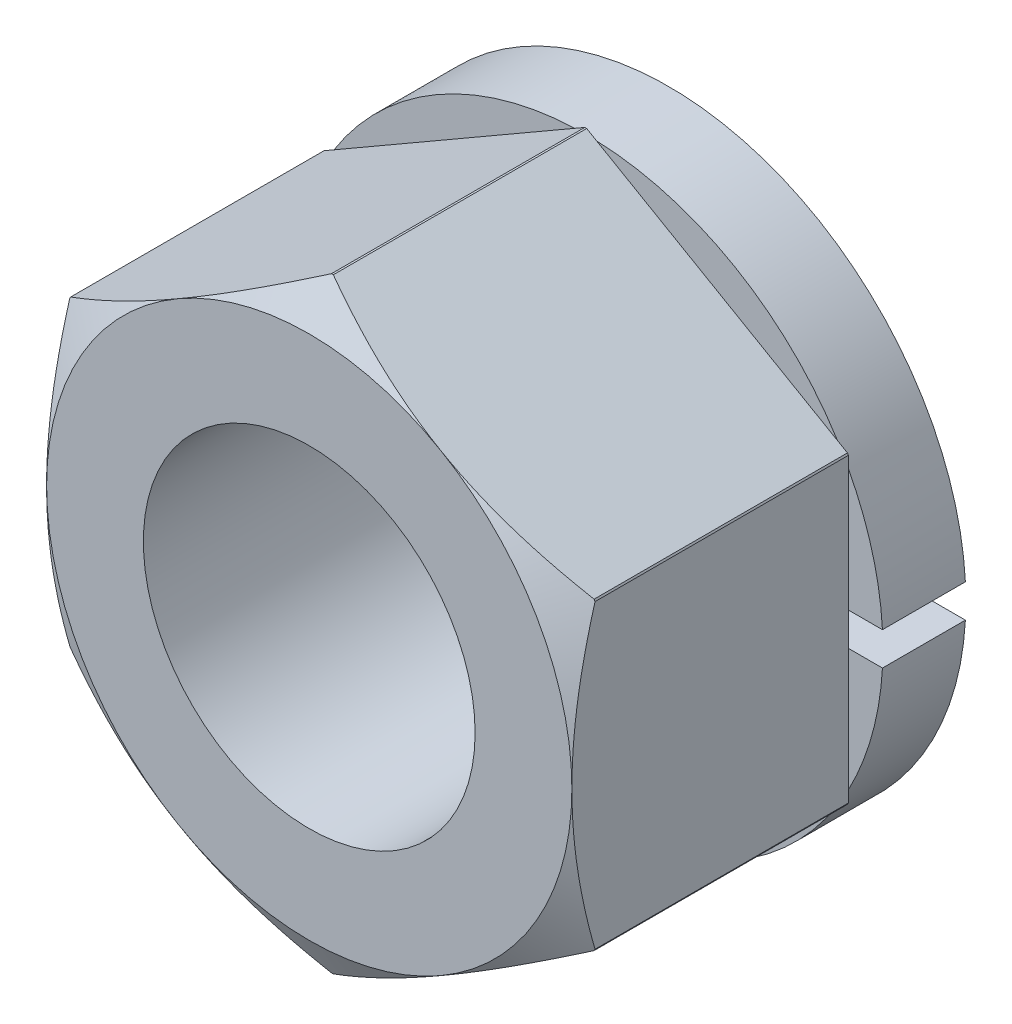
ISO-10303-21;
HEADER;
FILE_DESCRIPTION(('STEP AP214'),'2;1');
FILE_NAME('part.step','',(''),(''),'','','');
FILE_SCHEMA(('AUTOMOTIVE_DESIGN { 1 0 10303 214 1 1 1 1 }'));
ENDSEC;
DATA;
#1=APPLICATION_CONTEXT('core data for automotive mechanical design processes');
#2=APPLICATION_PROTOCOL_DEFINITION('international standard','automotive_design',2000,#1);
#3=PRODUCT_CONTEXT('',#1,'mechanical');
#4=PRODUCT('Part','Part','',(#3));
#5=PRODUCT_RELATED_PRODUCT_CATEGORY('part','',(#4));
#6=PRODUCT_DEFINITION_FORMATION('','',#4);
#7=PRODUCT_DEFINITION_CONTEXT('part definition',#1,'design');
#8=PRODUCT_DEFINITION('design','',#6,#7);
#9=PRODUCT_DEFINITION_SHAPE('','',#8);
#10=(LENGTH_UNIT() NAMED_UNIT(*) SI_UNIT(.MILLI.,.METRE.));
#11=(NAMED_UNIT(*) PLANE_ANGLE_UNIT() SI_UNIT($,.RADIAN.));
#12=(NAMED_UNIT(*) SI_UNIT($,.STERADIAN.) SOLID_ANGLE_UNIT());
#13=UNCERTAINTY_MEASURE_WITH_UNIT(LENGTH_MEASURE(1.E-05),#10,'distance_accuracy_value','');
#14=(GEOMETRIC_REPRESENTATION_CONTEXT(3) GLOBAL_UNCERTAINTY_ASSIGNED_CONTEXT((#13)) GLOBAL_UNIT_ASSIGNED_CONTEXT((#10,
#11,#12)) REPRESENTATION_CONTEXT('',''));
#15=CARTESIAN_POINT('',(0.,0.,0.));
#16=DIRECTION('',(0.,0.,1.));
#17=DIRECTION('',(1.,0.,0.));
#18=AXIS2_PLACEMENT_3D('',#15,#16,#17);
#19=CARTESIAN_POINT('',(0.,-10.95,3.));
#20=DIRECTION('',(0.,0.,1.));
#21=DIRECTION('',(-1.,0.,0.));
#22=AXIS2_PLACEMENT_3D('',#19,#20,#21);
#23=PLANE('',#22);
#24=DIRECTION('',(0.,-1.,0.));
#25=VECTOR('',#24,1.);
#26=CARTESIAN_POINT('',(9.5,5.4848275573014,3.));
#27=LINE('',#26,#25);
#28=CARTESIAN_POINT('',(9.5,5.44541091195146,3.));
#29=VERTEX_POINT('',#28);
#30=CARTESIAN_POINT('',(9.5,5.03115294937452,3.));
#31=VERTEX_POINT('',#30);
#32=EDGE_CURVE('E229',#29,#31,#27,.T.);
#33=ORIENTED_EDGE('',*,*,#32,.T.);
#34=CARTESIAN_POINT('',(0.,0.,3.));
#35=DIRECTION('',(0.,0.,1.));
#36=DIRECTION('',(0.,-1.,0.));
#37=AXIS2_PLACEMENT_3D('',#34,#35,#36);
#38=CIRCLE('',#37,10.75);
#39=CARTESIAN_POINT('',(9.10710626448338,5.71166486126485,3.));
#40=VERTEX_POINT('',#39);
#41=EDGE_CURVE('E9',#31,#40,#38,.T.);
#42=ORIENTED_EDGE('',*,*,#41,.T.);
#43=DIRECTION('',(0.866025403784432,-0.500000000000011,0.));
#44=VECTOR('',#43,1.);
#45=CARTESIAN_POINT('',(0.,10.969655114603,3.));
#46=LINE('',#45,#44);
#47=CARTESIAN_POINT('',(9.46586418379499,5.50453587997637,3.));
#48=VERTEX_POINT('',#47);
#49=EDGE_CURVE('E536',#40,#48,#46,.T.);
#50=ORIENTED_EDGE('',*,*,#49,.T.);
#51=CARTESIAN_POINT('',(0.,0.,3.));
#52=DIRECTION('',(0.,0.,1.));
#53=DIRECTION('',(-1.,0.,0.));
#54=AXIS2_PLACEMENT_3D('',#51,#52,#53);
#55=CIRCLE('',#54,10.95);
#56=EDGE_CURVE('E473',#29,#48,#55,.T.);
#57=ORIENTED_EDGE('',*,*,#56,.F.);
#58=EDGE_LOOP('',(#33,#42,#50,#57));
#59=FACE_BOUND('',#58,.T.);
#60=ADVANCED_FACE('F14',(#59),#23,.F.);
#61=CARTESIAN_POINT('',(0.034135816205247,10.9499467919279,3.));
#62=VERTEX_POINT('',#61);
#63=CARTESIAN_POINT('',(0.392893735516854,10.7428178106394,3.));
#64=VERTEX_POINT('',#63);
#65=EDGE_CURVE('E538',#62,#64,#46,.T.);
#66=ORIENTED_EDGE('',*,*,#65,.T.);
#67=CARTESIAN_POINT('',(-0.392893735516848,10.7428178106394,3.));
#68=VERTEX_POINT('',#67);
#69=EDGE_CURVE('E24',#64,#68,#38,.T.);
#70=ORIENTED_EDGE('',*,*,#69,.T.);
#71=DIRECTION('',(0.866025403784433,0.50000000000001,0.));
#72=VECTOR('',#71,1.);
#73=CARTESIAN_POINT('',(-9.5,5.4848275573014,3.));
#74=LINE('',#73,#72);
#75=CARTESIAN_POINT('',(-0.0341358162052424,10.9499467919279,3.));
#76=VERTEX_POINT('',#75);
#77=EDGE_CURVE('E516',#68,#76,#74,.T.);
#78=ORIENTED_EDGE('',*,*,#77,.T.);
#79=EDGE_CURVE('E468',#62,#76,#55,.T.);
#80=ORIENTED_EDGE('',*,*,#79,.F.);
#81=EDGE_LOOP('',(#66,#70,#78,#80));
#82=FACE_BOUND('',#81,.T.);
#83=ADVANCED_FACE('F811',(#82),#23,.F.);
#84=CARTESIAN_POINT('',(-9.46586418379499,5.50453587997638,3.));
#85=VERTEX_POINT('',#84);
#86=CARTESIAN_POINT('',(-9.10710626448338,5.71166486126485,3.));
#87=VERTEX_POINT('',#86);
#88=EDGE_CURVE('E531',#85,#87,#74,.T.);
#89=ORIENTED_EDGE('',*,*,#88,.T.);
#90=CARTESIAN_POINT('',(-9.5,5.03115294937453,3.));
#91=VERTEX_POINT('',#90);
#92=EDGE_CURVE('E609',#87,#91,#38,.T.);
#93=ORIENTED_EDGE('',*,*,#92,.T.);
#94=DIRECTION('',(0.,1.,0.));
#95=VECTOR('',#94,1.);
#96=CARTESIAN_POINT('',(-9.5,-5.4848275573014,3.));
#97=LINE('',#96,#95);
#98=CARTESIAN_POINT('',(-9.5,5.44541091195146,3.));
#99=VERTEX_POINT('',#98);
#100=EDGE_CURVE('E518',#91,#99,#97,.T.);
#101=ORIENTED_EDGE('',*,*,#100,.T.);
#102=EDGE_CURVE('E462',#85,#99,#55,.T.);
#103=ORIENTED_EDGE('',*,*,#102,.F.);
#104=EDGE_LOOP('',(#89,#93,#101,#103));
#105=FACE_BOUND('',#104,.T.);
#106=ADVANCED_FACE('F819',(#105),#23,.F.);
#107=CARTESIAN_POINT('',(-9.5,-5.44541091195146,3.));
#108=VERTEX_POINT('',#107);
#109=CARTESIAN_POINT('',(-9.5,-5.03115294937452,3.));
#110=VERTEX_POINT('',#109);
#111=EDGE_CURVE('E524',#108,#110,#97,.T.);
#112=ORIENTED_EDGE('',*,*,#111,.T.);
#113=CARTESIAN_POINT('',(-9.10710626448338,-5.71166486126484,3.));
#114=VERTEX_POINT('',#113);
#115=EDGE_CURVE('E210',#110,#114,#38,.T.);
#116=ORIENTED_EDGE('',*,*,#115,.T.);
#117=DIRECTION('',(-0.866025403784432,0.500000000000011,0.));
#118=VECTOR('',#117,1.);
#119=CARTESIAN_POINT('',(0.,-10.969655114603,3.));
#120=LINE('',#119,#118);
#121=CARTESIAN_POINT('',(-9.46586418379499,-5.50453587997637,3.));
#122=VERTEX_POINT('',#121);
#123=EDGE_CURVE('E390',#114,#122,#120,.T.);
#124=ORIENTED_EDGE('',*,*,#123,.T.);
#125=EDGE_CURVE('E459',#108,#122,#55,.T.);
#126=ORIENTED_EDGE('',*,*,#125,.F.);
#127=EDGE_LOOP('',(#112,#116,#124,#126));
#128=FACE_BOUND('',#127,.T.);
#129=ADVANCED_FACE('F586',(#128),#23,.F.);
#130=CARTESIAN_POINT('',(-0.0341358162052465,-10.9499467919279,3.));
#131=VERTEX_POINT('',#130);
#132=CARTESIAN_POINT('',(-0.392893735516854,-10.7428178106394,3.));
#133=VERTEX_POINT('',#132);
#134=EDGE_CURVE('E205',#131,#133,#120,.T.);
#135=ORIENTED_EDGE('',*,*,#134,.T.);
#136=CARTESIAN_POINT('',(0.392893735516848,-10.7428178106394,3.));
#137=VERTEX_POINT('',#136);
#138=EDGE_CURVE('E198',#133,#137,#38,.T.);
#139=ORIENTED_EDGE('',*,*,#138,.T.);
#140=DIRECTION('',(-0.866025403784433,-0.50000000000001,0.));
#141=VECTOR('',#140,1.);
#142=CARTESIAN_POINT('',(9.5,-5.4848275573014,3.));
#143=LINE('',#142,#141);
#144=CARTESIAN_POINT('',(0.0341358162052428,-10.9499467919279,3.));
#145=VERTEX_POINT('',#144);
#146=EDGE_CURVE('E203',#137,#145,#143,.T.);
#147=ORIENTED_EDGE('',*,*,#146,.T.);
#148=EDGE_CURVE('E461',#131,#145,#55,.T.);
#149=ORIENTED_EDGE('',*,*,#148,.F.);
#150=EDGE_LOOP('',(#135,#139,#147,#149));
#151=FACE_BOUND('',#150,.T.);
#152=ADVANCED_FACE('F200',(#151),#23,.F.);
#153=CARTESIAN_POINT('',(0.,0.,3.));
#154=DIRECTION('',(0.,0.,-1.));
#155=DIRECTION('',(0.,1.,0.));
#156=AXIS2_PLACEMENT_3D('',#153,#154,#155);
#157=CIRCLE('',#156,6.);
#158=CARTESIAN_POINT('',(0.,6.,3.));
#159=VERTEX_POINT('',#158);
#160=EDGE_CURVE('E409',#159,#159,#157,.T.);
#161=ORIENTED_EDGE('',*,*,#160,.F.);
#162=EDGE_LOOP('',(#161));
#163=FACE_BOUND('',#162,.T.);
#164=DIRECTION('',(-1.,0.,0.));
#165=VECTOR('',#164,1.);
#166=CARTESIAN_POINT('',(0.,0.6,3.));
#167=LINE('',#166,#165);
#168=CARTESIAN_POINT('',(9.5,0.6,3.));
#169=VERTEX_POINT('',#168);
#170=CARTESIAN_POINT('',(6.07042008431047,0.6,3.));
#171=VERTEX_POINT('',#170);
#172=EDGE_CURVE('E397',#169,#171,#167,.T.);
#173=ORIENTED_EDGE('',*,*,#172,.F.);
#174=CARTESIAN_POINT('',(9.5,-0.6,3.));
#175=VERTEX_POINT('',#174);
#176=EDGE_CURVE('E547',#169,#175,#27,.T.);
#177=ORIENTED_EDGE('',*,*,#176,.T.);
#178=DIRECTION('',(1.,0.,0.));
#179=VECTOR('',#178,1.);
#180=CARTESIAN_POINT('',(0.,-0.6,3.));
#181=LINE('',#180,#179);
#182=CARTESIAN_POINT('',(6.07042008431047,-0.6,3.));
#183=VERTEX_POINT('',#182);
#184=EDGE_CURVE('E34',#183,#175,#181,.T.);
#185=ORIENTED_EDGE('',*,*,#184,.F.);
#186=CARTESIAN_POINT('',(0.,0.,3.));
#187=DIRECTION('',(0.,0.,1.));
#188=DIRECTION('',(0.,-1.,0.));
#189=AXIS2_PLACEMENT_3D('',#186,#187,#188);
#190=CIRCLE('',#189,6.1);
#191=EDGE_CURVE('E403',#171,#183,#190,.T.);
#192=ORIENTED_EDGE('',*,*,#191,.F.);
#193=EDGE_LOOP('',(#173,#177,#185,#192));
#194=FACE_BOUND('',#193,.T.);
#195=ADVANCED_FACE('F323',(#163,#194),#23,.F.);
#196=CARTESIAN_POINT('',(0.,0.,12.162842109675));
#197=DIRECTION('',(0.,0.,-1.));
#198=DIRECTION('',(1.,0.,0.));
#199=AXIS2_PLACEMENT_3D('',#196,#197,#198);
#200=CONICAL_SURFACE('',#199,10.95,1.04719755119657);
#201=CARTESIAN_POINT('',(0.,0.,12.162842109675));
#202=DIRECTION('',(0.,0.,1.));
#203=DIRECTION('',(-1.,0.,0.));
#204=AXIS2_PLACEMENT_3D('',#201,#202,#203);
#205=CIRCLE('',#204,10.95);
#206=CARTESIAN_POINT('',(-9.5,-5.44541091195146,12.162842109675));
#207=VERTEX_POINT('',#206);
#208=CARTESIAN_POINT('',(-9.46586418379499,-5.50453587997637,12.162842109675));
#209=VERTEX_POINT('',#208);
#210=EDGE_CURVE('E455',#207,#209,#205,.T.);
#211=ORIENTED_EDGE('',*,*,#210,.T.);
#212=CARTESIAN_POINT('',(-9.46646741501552,-5.50418760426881,12.162642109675));
#213=CARTESIAN_POINT('',(-9.25791988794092,-5.62459257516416,12.2317756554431));
#214=CARTESIAN_POINT('',(-9.04859514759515,-5.74544627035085,12.2977390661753));
#215=CARTESIAN_POINT('',(-8.62827068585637,-5.98812071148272,12.4224510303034));
#216=CARTESIAN_POINT('',(-8.41727043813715,-6.1099417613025,12.4811972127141));
#217=CARTESIAN_POINT('',(-7.78089858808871,-6.47735122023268,12.6454597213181));
#218=CARTESIAN_POINT('',(-7.35302472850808,-6.72438430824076,12.7387042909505));
#219=CARTESIAN_POINT('',(-6.71273749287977,-7.09405431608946,12.847707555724));
#220=CARTESIAN_POINT('',(-6.50221448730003,-7.21559983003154,12.8786921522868));
#221=CARTESIAN_POINT('',(-6.08020995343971,-7.45924426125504,12.9304902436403));
#222=CARTESIAN_POINT('',(-5.86872840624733,-7.5813431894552,12.9513035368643));
#223=CARTESIAN_POINT('',(-5.44542723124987,-7.82573623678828,12.9822258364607));
#224=CARTESIAN_POINT('',(-5.23360829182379,-7.94802995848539,12.9923473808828));
#225=CARTESIAN_POINT('',(-4.80979337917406,-8.1927196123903,13.0016723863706));
#226=CARTESIAN_POINT('',(-4.59779741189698,-8.31511554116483,13.0008762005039));
#227=CARTESIAN_POINT('',(-4.20367970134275,-8.54265950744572,12.9892613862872));
#228=CARTESIAN_POINT('',(-4.02152562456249,-8.6478262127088,12.9798597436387));
#229=CARTESIAN_POINT('',(-3.65764622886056,-8.85791207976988,12.9531812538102));
#230=CARTESIAN_POINT('',(-3.47592093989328,-8.9628312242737,12.9359038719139));
#231=CARTESIAN_POINT('',(-2.93145449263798,-9.27717907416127,12.8726566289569));
#232=CARTESIAN_POINT('',(-2.56967084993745,-9.48605495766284,12.8152796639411));
#233=CARTESIAN_POINT('',(-1.84235216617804,-9.90597259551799,12.6722649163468));
#234=CARTESIAN_POINT('',(-1.47690682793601,-10.1169625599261,12.5860392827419));
#235=CARTESIAN_POINT('',(-0.751369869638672,-10.5358515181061,12.3905074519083));
#236=CARTESIAN_POINT('',(-0.3912694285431,-10.743755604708,12.281245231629));
#237=CARTESIAN_POINT('',(-0.0336972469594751,-10.9502,12.1626967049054));
#238=B_SPLINE_CURVE_WITH_KNOTS('',3,(#212,#213,#214,#215,#216,#217,#218,#219,#220,#221,#222,
#223,#224,#225,#226,#227,#228,#229,#230,#231,#232,#233,#234,#235,#236,#237),.UNSPECIFIED.,.F.,
.F.,(4,2,2,2,2,2,2,2,2,2,2,2,4),(0.,0.751551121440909,1.50334848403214,3.01007593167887,
3.74507773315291,4.48009409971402,5.21424756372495,5.94837728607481,6.57985506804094,
7.21137573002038,8.47527470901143,9.76667924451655,11.055640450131),.UNSPECIFIED.);
#239=CARTESIAN_POINT('',(-4.75000000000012,-8.22724133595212,13.));
#240=VERTEX_POINT('',#239);
#241=EDGE_CURVE('E469',#209,#240,#238,.T.);
#242=ORIENTED_EDGE('',*,*,#241,.T.);
#243=CARTESIAN_POINT('',(0.,0.,13.));
#244=DIRECTION('',(0.,0.,1.));
#245=DIRECTION('',(-1.,0.,0.));
#246=AXIS2_PLACEMENT_3D('',#243,#244,#245);
#247=CIRCLE('',#246,9.5);
#248=CARTESIAN_POINT('',(-9.5,0.,13.));
#249=VERTEX_POINT('',#248);
#250=EDGE_CURVE('E450',#249,#240,#247,.T.);
#251=ORIENTED_EDGE('',*,*,#250,.F.);
#252=CARTESIAN_POINT('',(-9.5,14.5449970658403,8.4547571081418));
#253=CARTESIAN_POINT('',(-9.5,14.3364590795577,8.5555580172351));
#254=CARTESIAN_POINT('',(-9.5,14.1276689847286,8.65583711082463));
#255=CARTESIAN_POINT('',(-9.5,13.7095313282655,8.85523188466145));
#256=CARTESIAN_POINT('',(-9.5,13.5001837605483,8.95434755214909));
#257=CARTESIAN_POINT('',(-9.5,12.8711636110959,9.24979848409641));
#258=CARTESIAN_POINT('',(-9.5,12.4505814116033,9.44420479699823));
#259=CARTESIAN_POINT('',(-9.5,11.6041025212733,9.82773091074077));
#260=CARTESIAN_POINT('',(-9.5,11.1781891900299,10.0168140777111));
#261=CARTESIAN_POINT('',(-9.5,10.3228620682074,10.3868597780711));
#262=CARTESIAN_POINT('',(-9.5,9.89344846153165,10.5678227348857));
#263=CARTESIAN_POINT('',(-9.5,9.02511307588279,10.9216089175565));
#264=CARTESIAN_POINT('',(-9.5,8.58613927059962,11.0943051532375));
#265=CARTESIAN_POINT('',(-9.5,7.70301457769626,11.4261685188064));
#266=CARTESIAN_POINT('',(-9.5,7.25886312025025,11.5853341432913));
#267=CARTESIAN_POINT('',(-9.5,6.36558372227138,11.8858574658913));
#268=CARTESIAN_POINT('',(-9.5,5.91646866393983,12.0272530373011));
#269=CARTESIAN_POINT('',(-9.5,5.01187000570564,12.2876455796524));
#270=CARTESIAN_POINT('',(-9.5,4.55638846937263,12.4066496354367));
#271=CARTESIAN_POINT('',(-9.5,3.63866898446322,12.6164722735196));
#272=CARTESIAN_POINT('',(-9.5,3.17642925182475,12.707283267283));
#273=CARTESIAN_POINT('',(-9.5,2.47900345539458,12.8178070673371));
#274=CARTESIAN_POINT('',(-9.5,2.24582186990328,12.8503686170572));
#275=CARTESIAN_POINT('',(-9.5,1.77836599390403,12.9062867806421));
#276=CARTESIAN_POINT('',(-9.5,1.54409181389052,12.9296443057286));
#277=CARTESIAN_POINT('',(-9.5,1.07625265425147,12.9665259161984));
#278=CARTESIAN_POINT('',(-9.5,0.84269250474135,12.9801110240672));
#279=CARTESIAN_POINT('',(-9.5,0.375206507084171,12.9973759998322));
#280=CARTESIAN_POINT('',(-9.5,0.141280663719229,13.0010559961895));
#281=CARTESIAN_POINT('',(-9.5,-0.326449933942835,12.9984230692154));
#282=CARTESIAN_POINT('',(-9.5,-0.560254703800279,12.9921129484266));
#283=CARTESIAN_POINT('',(-9.5,-1.0273945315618,12.9696566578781));
#284=CARTESIAN_POINT('',(-9.5,-1.26072956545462,12.9535099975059));
#285=CARTESIAN_POINT('',(-9.5,-1.82631241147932,12.9027870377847));
#286=CARTESIAN_POINT('',(-9.5,-2.15812521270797,12.8632794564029));
#287=CARTESIAN_POINT('',(-9.5,-2.81920709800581,12.7665661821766));
#288=CARTESIAN_POINT('',(-9.5,-3.14847546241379,12.7093556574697));
#289=CARTESIAN_POINT('',(-9.5,-3.80419719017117,12.5792655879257));
#290=CARTESIAN_POINT('',(-9.5,-4.13064758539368,12.5063712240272));
#291=CARTESIAN_POINT('',(-9.5,-4.78018916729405,12.3471374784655));
#292=CARTESIAN_POINT('',(-9.5,-5.10328066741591,12.2607993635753));
#293=CARTESIAN_POINT('',(-9.5,-5.75405995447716,12.0744873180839));
#294=CARTESIAN_POINT('',(-9.5,-6.08166636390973,11.9742310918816));
#295=CARTESIAN_POINT('',(-9.5,-6.73341634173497,11.7638161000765));
#296=CARTESIAN_POINT('',(-9.5,-7.05756212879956,11.6536641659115));
#297=CARTESIAN_POINT('',(-9.5,-7.70109015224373,11.4257327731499));
#298=CARTESIAN_POINT('',(-9.5,-8.02048893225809,11.3079997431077));
#299=CARTESIAN_POINT('',(-9.5,-8.65680868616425,11.0656255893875));
#300=CARTESIAN_POINT('',(-9.5,-8.97372859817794,10.9409816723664));
#301=CARTESIAN_POINT('',(-9.5,-9.28949732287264,10.813566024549));
#302=B_SPLINE_CURVE_WITH_KNOTS('',3,(#252,#253,#254,#255,#256,#257,#258,#259,#260,#261,#262,
#263,#264,#265,#266,#267,#268,#269,#270,#271,#272,#273,#274,#275,#276,#277,#278,#279,#280,#281,
#282,#283,#284,#285,#286,#287,#288,#289,#290,#291,#292,#293,#294,#295,#296,#297,#298,#299,#300,
#301),.UNSPECIFIED.,.F.,.F.,(4,2,2,2,2,2,2,2,2,2,2,2,2,2,2,2,2,2,2,2,2,2,2,2,4),(0.,
0.694865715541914,1.38973904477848,2.77971182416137,4.17764160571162,5.5754984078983,
6.99049259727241,8.40564401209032,9.81772623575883,11.2293609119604,12.6413752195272,
13.3475542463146,14.0536633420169,14.7553240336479,15.4569756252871,16.158430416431,
16.8599201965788,17.8618314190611,18.8640163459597,19.8671523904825,20.8701939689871,
21.8978146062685,22.9247312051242,23.9458669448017,24.9674184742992),.UNSPECIFIED.);
#303=EDGE_CURVE('E295',#249,#207,#302,.T.);
#304=ORIENTED_EDGE('',*,*,#303,.T.);
#305=EDGE_LOOP('',(#211,#242,#251,#304));
#306=FACE_BOUND('',#305,.T.);
#307=ADVANCED_FACE('F334',(#306),#200,.T.);
#308=CARTESIAN_POINT('',(-9.46586418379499,5.50453587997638,12.162842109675));
#309=VERTEX_POINT('',#308);
#310=CARTESIAN_POINT('',(-9.5,5.44541091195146,12.162842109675));
#311=VERTEX_POINT('',#310);
#312=EDGE_CURVE('E458',#309,#311,#205,.T.);
#313=ORIENTED_EDGE('',*,*,#312,.T.);
#314=EDGE_CURVE('E302',#311,#249,#302,.T.);
#315=ORIENTED_EDGE('',*,*,#314,.T.);
#316=CARTESIAN_POINT('',(-4.75000000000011,8.22724133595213,13.));
#317=VERTEX_POINT('',#316);
#318=EDGE_CURVE('E454',#317,#249,#247,.T.);
#319=ORIENTED_EDGE('',*,*,#318,.F.);
#320=CARTESIAN_POINT('',(-0.0336972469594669,10.9502,12.1626967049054));
#321=CARTESIAN_POINT('',(-0.242243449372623,10.8297957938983,12.2318279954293));
#322=CARTESIAN_POINT('',(-0.451566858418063,10.7089428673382,12.297789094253));
#323=CARTESIAN_POINT('',(-0.871888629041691,10.4662699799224,12.4224963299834));
#324=CARTESIAN_POINT('',(-1.08288751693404,10.344449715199,12.4812400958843));
#325=CARTESIAN_POINT('',(-1.7192551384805,9.9770426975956,12.6454951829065));
#326=CARTESIAN_POINT('',(-2.14712606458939,9.73001130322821,12.7387346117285));
#327=CARTESIAN_POINT('',(-2.78740876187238,9.3603439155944,12.8477301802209));
#328=CARTESIAN_POINT('',(-2.99793028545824,9.2387992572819,12.8787122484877));
#329=CARTESIAN_POINT('',(-3.41993176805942,8.99515658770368,12.9305053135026));
#330=CARTESIAN_POINT('',(-3.6314117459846,8.87305856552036,12.9513161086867));
#331=CARTESIAN_POINT('',(-4.05470970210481,8.62866737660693,12.9822335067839));
#332=CARTESIAN_POINT('',(-4.26652699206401,8.50637460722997,12.9923526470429));
#333=CARTESIAN_POINT('',(-4.69033851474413,8.26168691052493,13.0016729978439));
#334=CARTESIAN_POINT('',(-4.90233274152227,8.13929198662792,13.0008745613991));
#335=CARTESIAN_POINT('',(-5.29645037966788,7.91174806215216,12.9892556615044));
#336=CARTESIAN_POINT('',(-5.47860613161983,7.80658038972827,12.9798520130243));
#337=CARTESIAN_POINT('',(-5.84248881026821,7.59649262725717,12.9531694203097));
#338=CARTESIAN_POINT('',(-6.02421570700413,7.49157255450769,12.9358899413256));
#339=CARTESIAN_POINT('',(-6.56868688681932,7.17722197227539,12.8726363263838));
#340=CARTESIAN_POINT('',(-6.93047355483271,6.96834434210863,12.815255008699));
#341=CARTESIAN_POINT('',(-7.65779822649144,6.5484232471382,12.6722315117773));
#342=CARTESIAN_POINT('',(-8.02324652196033,6.33743157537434,12.5860014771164));
#343=CARTESIAN_POINT('',(-8.74878922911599,5.91853929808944,12.3904610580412));
#344=CARTESIAN_POINT('',(-9.1088924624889,5.71063359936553,12.2811946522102));
#345=CARTESIAN_POINT('',(-9.46646741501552,5.50418760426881,12.162642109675));
#346=B_SPLINE_CURVE_WITH_KNOTS('',3,(#320,#321,#322,#323,#324,#325,#326,#327,#328,#329,#330,
#331,#332,#333,#334,#335,#336,#337,#338,#339,#340,#341,#342,#343,#344,#345),.UNSPECIFIED.,.F.,
.F.,(4,2,2,2,2,2,2,2,2,2,2,2,4),(0.,0.751544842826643,1.50333592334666,3.01005049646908,
3.74504624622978,4.4800565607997,5.21420402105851,5.94832774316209,6.57981158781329,
7.21133831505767,8.47524945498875,9.76666668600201,11.0556404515),.UNSPECIFIED.);
#347=EDGE_CURVE('E287',#317,#309,#346,.T.);
#348=ORIENTED_EDGE('',*,*,#347,.T.);
#349=EDGE_LOOP('',(#313,#315,#319,#348));
#350=FACE_BOUND('',#349,.T.);
#351=ADVANCED_FACE('F484',(#350),#200,.T.);
#352=CARTESIAN_POINT('',(0.034135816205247,10.9499467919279,12.162842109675));
#353=VERTEX_POINT('',#352);
#354=CARTESIAN_POINT('',(-0.0341358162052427,10.9499467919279,12.162842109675));
#355=VERTEX_POINT('',#354);
#356=EDGE_CURVE('E465',#353,#355,#205,.T.);
#357=ORIENTED_EDGE('',*,*,#356,.T.);
#358=EDGE_CURVE('E294',#355,#317,#346,.T.);
#359=ORIENTED_EDGE('',*,*,#358,.T.);
#360=CARTESIAN_POINT('',(4.75000000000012,8.22724133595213,13.));
#361=VERTEX_POINT('',#360);
#362=EDGE_CURVE('E493',#361,#317,#247,.T.);
#363=ORIENTED_EDGE('',*,*,#362,.F.);
#364=CARTESIAN_POINT('',(9.46646741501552,5.50418760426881,12.162642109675));
#365=CARTESIAN_POINT('',(9.25791988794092,5.62459257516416,12.2317756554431));
#366=CARTESIAN_POINT('',(9.04859514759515,5.74544627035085,12.2977390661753));
#367=CARTESIAN_POINT('',(8.62827068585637,5.98812071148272,12.4224510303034));
#368=CARTESIAN_POINT('',(8.41727043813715,6.1099417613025,12.4811972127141));
#369=CARTESIAN_POINT('',(7.7808985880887,6.47735122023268,12.6454597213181));
#370=CARTESIAN_POINT('',(7.35302472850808,6.72438430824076,12.7387042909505));
#371=CARTESIAN_POINT('',(6.71273749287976,7.09405431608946,12.847707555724));
#372=CARTESIAN_POINT('',(6.50221448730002,7.21559983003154,12.8786921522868));
#373=CARTESIAN_POINT('',(6.0802099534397,7.45924426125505,12.9304902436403));
#374=CARTESIAN_POINT('',(5.86872840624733,7.58134318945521,12.9513035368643));
#375=CARTESIAN_POINT('',(5.44542723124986,7.82573623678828,12.9822258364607));
#376=CARTESIAN_POINT('',(5.23360829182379,7.94802995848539,12.9923473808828));
#377=CARTESIAN_POINT('',(4.80979337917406,8.1927196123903,13.0016723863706));
#378=CARTESIAN_POINT('',(4.59779741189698,8.31511554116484,13.0008762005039));
#379=CARTESIAN_POINT('',(4.20367970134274,8.54265950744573,12.9892613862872));
#380=CARTESIAN_POINT('',(4.02152562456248,8.64782621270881,12.9798597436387));
#381=CARTESIAN_POINT('',(3.65764622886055,8.85791207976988,12.9531812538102));
#382=CARTESIAN_POINT('',(3.47592093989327,8.9628312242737,12.9359038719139));
#383=CARTESIAN_POINT('',(2.93145449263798,9.27717907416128,12.8726566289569));
#384=CARTESIAN_POINT('',(2.56967084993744,9.48605495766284,12.8152796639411));
#385=CARTESIAN_POINT('',(1.84235216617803,9.90597259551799,12.6722649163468));
#386=CARTESIAN_POINT('',(1.47690682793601,10.1169625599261,12.5860392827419));
#387=CARTESIAN_POINT('',(0.751369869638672,10.5358515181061,12.3905074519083));
#388=CARTESIAN_POINT('',(0.3912694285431,10.743755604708,12.281245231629));
#389=CARTESIAN_POINT('',(0.0336972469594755,10.9502,12.1626967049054));
#390=B_SPLINE_CURVE_WITH_KNOTS('',3,(#364,#365,#366,#367,#368,#369,#370,#371,#372,#373,#374,
#375,#376,#377,#378,#379,#380,#381,#382,#383,#384,#385,#386,#387,#388,#389),.UNSPECIFIED.,.F.,
.F.,(4,2,2,2,2,2,2,2,2,2,2,2,4),(0.,0.751551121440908,1.50334848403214,3.01007593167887,
3.74507773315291,4.48009409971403,5.21424756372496,5.94837728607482,6.57985506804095,
7.21137573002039,8.47527470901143,9.76667924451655,11.055640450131),.UNSPECIFIED.);
#391=EDGE_CURVE('E278',#361,#353,#390,.T.);
#392=ORIENTED_EDGE('',*,*,#391,.T.);
#393=EDGE_LOOP('',(#357,#359,#363,#392));
#394=FACE_BOUND('',#393,.T.);
#395=ADVANCED_FACE('F509',(#394),#200,.T.);
#396=CARTESIAN_POINT('',(9.5,5.44541091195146,12.162842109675));
#397=VERTEX_POINT('',#396);
#398=CARTESIAN_POINT('',(9.46586418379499,5.50453587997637,12.162842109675));
#399=VERTEX_POINT('',#398);
#400=EDGE_CURVE('E498',#397,#399,#205,.T.);
#401=ORIENTED_EDGE('',*,*,#400,.T.);
#402=EDGE_CURVE('E285',#399,#361,#390,.T.);
#403=ORIENTED_EDGE('',*,*,#402,.T.);
#404=CARTESIAN_POINT('',(9.5,0.,13.));
#405=VERTEX_POINT('',#404);
#406=EDGE_CURVE('E557',#405,#361,#247,.T.);
#407=ORIENTED_EDGE('',*,*,#406,.F.);
#408=CARTESIAN_POINT('',(9.5,14.5449970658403,8.4547571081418));
#409=CARTESIAN_POINT('',(9.5,14.3364590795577,8.5555580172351));
#410=CARTESIAN_POINT('',(9.5,14.1276689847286,8.65583711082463));
#411=CARTESIAN_POINT('',(9.5,13.7095313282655,8.85523188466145));
#412=CARTESIAN_POINT('',(9.5,13.5001837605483,8.95434755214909));
#413=CARTESIAN_POINT('',(9.5,12.8711636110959,9.24979848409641));
#414=CARTESIAN_POINT('',(9.5,12.4505814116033,9.44420479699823));
#415=CARTESIAN_POINT('',(9.5,11.6041025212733,9.82773091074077));
#416=CARTESIAN_POINT('',(9.5,11.1781891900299,10.0168140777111));
#417=CARTESIAN_POINT('',(9.5,10.3228620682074,10.3868597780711));
#418=CARTESIAN_POINT('',(9.5,9.89344846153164,10.5678227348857));
#419=CARTESIAN_POINT('',(9.5,9.02511307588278,10.9216089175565));
#420=CARTESIAN_POINT('',(9.5,8.58613927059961,11.0943051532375));
#421=CARTESIAN_POINT('',(9.5,7.70301457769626,11.4261685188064));
#422=CARTESIAN_POINT('',(9.5,7.25886312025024,11.5853341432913));
#423=CARTESIAN_POINT('',(9.5,6.36558372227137,11.8858574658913));
#424=CARTESIAN_POINT('',(9.5,5.91646866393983,12.0272530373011));
#425=CARTESIAN_POINT('',(9.5,5.01187000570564,12.2876455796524));
#426=CARTESIAN_POINT('',(9.5,4.55638846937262,12.4066496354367));
#427=CARTESIAN_POINT('',(9.5,3.63866898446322,12.6164722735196));
#428=CARTESIAN_POINT('',(9.5,3.17642925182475,12.707283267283));
#429=CARTESIAN_POINT('',(9.5,2.47900345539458,12.8178070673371));
#430=CARTESIAN_POINT('',(9.5,2.24582186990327,12.8503686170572));
#431=CARTESIAN_POINT('',(9.5,1.77836599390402,12.9062867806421));
#432=CARTESIAN_POINT('',(9.5,1.54409181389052,12.9296443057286));
#433=CARTESIAN_POINT('',(9.5,1.07625265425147,12.9665259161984));
#434=CARTESIAN_POINT('',(9.5,0.842692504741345,12.9801110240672));
#435=CARTESIAN_POINT('',(9.5,0.375206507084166,12.9973759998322));
#436=CARTESIAN_POINT('',(9.5,0.141280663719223,13.0010559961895));
#437=CARTESIAN_POINT('',(9.5,-0.32644993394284,12.9984230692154));
#438=CARTESIAN_POINT('',(9.5,-0.560254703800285,12.9921129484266));
#439=CARTESIAN_POINT('',(9.5,-1.02739453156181,12.9696566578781));
#440=CARTESIAN_POINT('',(9.5,-1.26072956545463,12.9535099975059));
#441=CARTESIAN_POINT('',(9.5,-1.82631241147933,12.9027870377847));
#442=CARTESIAN_POINT('',(9.5,-2.15812521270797,12.8632794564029));
#443=CARTESIAN_POINT('',(9.5,-2.81920709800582,12.7665661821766));
#444=CARTESIAN_POINT('',(9.5,-3.1484754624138,12.7093556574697));
#445=CARTESIAN_POINT('',(9.5,-3.80419719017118,12.5792655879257));
#446=CARTESIAN_POINT('',(9.5,-4.13064758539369,12.5063712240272));
#447=CARTESIAN_POINT('',(9.5,-4.78018916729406,12.3471374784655));
#448=CARTESIAN_POINT('',(9.5,-5.10328066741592,12.2607993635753));
#449=CARTESIAN_POINT('',(9.5,-5.75405995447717,12.0744873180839));
#450=CARTESIAN_POINT('',(9.5,-6.08166636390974,11.9742310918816));
#451=CARTESIAN_POINT('',(9.5,-6.73341634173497,11.7638161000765));
#452=CARTESIAN_POINT('',(9.5,-7.05756212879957,11.6536641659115));
#453=CARTESIAN_POINT('',(9.5,-7.70109015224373,11.4257327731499));
#454=CARTESIAN_POINT('',(9.5,-8.0204889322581,11.3079997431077));
#455=CARTESIAN_POINT('',(9.5,-8.65680868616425,11.0656255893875));
#456=CARTESIAN_POINT('',(9.5,-8.97372859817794,10.9409816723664));
#457=CARTESIAN_POINT('',(9.5,-9.28949732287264,10.813566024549));
#458=B_SPLINE_CURVE_WITH_KNOTS('',3,(#408,#409,#410,#411,#412,#413,#414,#415,#416,#417,#418,
#419,#420,#421,#422,#423,#424,#425,#426,#427,#428,#429,#430,#431,#432,#433,#434,#435,#436,#437,
#438,#439,#440,#441,#442,#443,#444,#445,#446,#447,#448,#449,#450,#451,#452,#453,#454,#455,#456,
#457),.UNSPECIFIED.,.F.,.F.,(4,2,2,2,2,2,2,2,2,2,2,2,2,2,2,2,2,2,2,2,2,2,2,2,4),(0.,
0.694865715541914,1.38973904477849,2.77971182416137,4.17764160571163,5.57549840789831,
6.99049259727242,8.40564401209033,9.81772623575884,11.2293609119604,12.6413752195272,
13.3475542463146,14.0536633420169,14.7553240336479,15.4569756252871,16.158430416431,
16.8599201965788,17.8618314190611,18.8640163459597,19.8671523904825,20.8701939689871,
21.8978146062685,22.9247312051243,23.9458669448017,24.9674184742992),.UNSPECIFIED.);
#459=EDGE_CURVE('E242',#405,#397,#458,.F.);
#460=ORIENTED_EDGE('',*,*,#459,.T.);
#461=EDGE_LOOP('',(#401,#403,#407,#460));
#462=FACE_BOUND('',#461,.T.);
#463=ADVANCED_FACE('F556',(#462),#200,.T.);
#464=CARTESIAN_POINT('',(9.46586418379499,-5.50453587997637,12.162842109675));
#465=VERTEX_POINT('',#464);
#466=CARTESIAN_POINT('',(9.5,-5.44541091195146,12.162842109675));
#467=VERTEX_POINT('',#466);
#468=EDGE_CURVE('E497',#465,#467,#205,.T.);
#469=ORIENTED_EDGE('',*,*,#468,.T.);
#470=EDGE_CURVE('E286',#467,#405,#458,.F.);
#471=ORIENTED_EDGE('',*,*,#470,.T.);
#472=CARTESIAN_POINT('',(4.75000000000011,-8.22724133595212,13.));
#473=VERTEX_POINT('',#472);
#474=EDGE_CURVE('E559',#473,#405,#247,.T.);
#475=ORIENTED_EDGE('',*,*,#474,.F.);
#476=CARTESIAN_POINT('',(0.0336972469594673,-10.9502,12.1626967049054));
#477=CARTESIAN_POINT('',(0.242243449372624,-10.8297957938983,12.2318279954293));
#478=CARTESIAN_POINT('',(0.451566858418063,-10.7089428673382,12.297789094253));
#479=CARTESIAN_POINT('',(0.871888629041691,-10.4662699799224,12.4224963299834));
#480=CARTESIAN_POINT('',(1.08288751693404,-10.344449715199,12.4812400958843));
#481=CARTESIAN_POINT('',(1.7192551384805,-9.9770426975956,12.6454951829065));
#482=CARTESIAN_POINT('',(2.14712606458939,-9.73001130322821,12.7387346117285));
#483=CARTESIAN_POINT('',(2.78740876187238,-9.3603439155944,12.8477301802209));
#484=CARTESIAN_POINT('',(2.99793028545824,-9.2387992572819,12.8787122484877));
#485=CARTESIAN_POINT('',(3.41993176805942,-8.99515658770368,12.9305053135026));
#486=CARTESIAN_POINT('',(3.6314117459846,-8.87305856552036,12.9513161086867));
#487=CARTESIAN_POINT('',(4.05470970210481,-8.62866737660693,12.9822335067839));
#488=CARTESIAN_POINT('',(4.26652699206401,-8.50637460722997,12.9923526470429));
#489=CARTESIAN_POINT('',(4.69033851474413,-8.26168691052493,13.0016729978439));
#490=CARTESIAN_POINT('',(4.90233274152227,-8.13929198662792,13.0008745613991));
#491=CARTESIAN_POINT('',(5.29645037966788,-7.91174806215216,12.9892556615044));
#492=CARTESIAN_POINT('',(5.47860613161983,-7.80658038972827,12.9798520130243));
#493=CARTESIAN_POINT('',(5.84248881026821,-7.59649262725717,12.9531694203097));
#494=CARTESIAN_POINT('',(6.02421570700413,-7.49157255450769,12.9358899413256));
#495=CARTESIAN_POINT('',(6.56868688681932,-7.17722197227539,12.8726363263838));
#496=CARTESIAN_POINT('',(6.93047355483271,-6.96834434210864,12.815255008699));
#497=CARTESIAN_POINT('',(7.65779822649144,-6.5484232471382,12.6722315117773));
#498=CARTESIAN_POINT('',(8.02324652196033,-6.33743157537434,12.5860014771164));
#499=CARTESIAN_POINT('',(8.74878922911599,-5.91853929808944,12.3904610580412));
#500=CARTESIAN_POINT('',(9.1088924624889,-5.71063359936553,12.2811946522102));
#501=CARTESIAN_POINT('',(9.46646741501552,-5.50418760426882,12.162642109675));
#502=B_SPLINE_CURVE_WITH_KNOTS('',3,(#476,#477,#478,#479,#480,#481,#482,#483,#484,#485,#486,
#487,#488,#489,#490,#491,#492,#493,#494,#495,#496,#497,#498,#499,#500,#501),.UNSPECIFIED.,.F.,
.F.,(4,2,2,2,2,2,2,2,2,2,2,2,4),(0.,0.751544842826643,1.50333592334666,3.01005049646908,
3.74504624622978,4.4800565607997,5.21420402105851,5.94832774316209,6.57981158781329,
7.21133831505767,8.47524945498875,9.76666668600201,11.0556404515),.UNSPECIFIED.);
#503=EDGE_CURVE('E69',#473,#465,#502,.T.);
#504=ORIENTED_EDGE('',*,*,#503,.T.);
#505=EDGE_LOOP('',(#469,#471,#475,#504));
#506=FACE_BOUND('',#505,.T.);
#507=ADVANCED_FACE('F335',(#506),#200,.T.);
#508=CARTESIAN_POINT('',(0.,0.,3.));
#509=DIRECTION('',(0.,0.,1.));
#510=DIRECTION('',(-1.,0.,0.));
#511=AXIS2_PLACEMENT_3D('',#508,#509,#510);
#512=CYLINDRICAL_SURFACE('',#511,10.95);
#513=ORIENTED_EDGE('',*,*,#125,.T.);
#514=DIRECTION('',(0.,0.,1.));
#515=VECTOR('',#514,1.);
#516=CARTESIAN_POINT('',(-9.46586418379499,-5.50453587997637,3.));
#517=LINE('',#516,#515);
#518=EDGE_CURVE('E416',#122,#209,#517,.T.);
#519=ORIENTED_EDGE('',*,*,#518,.T.);
#520=ORIENTED_EDGE('',*,*,#210,.F.);
#521=DIRECTION('',(0.,0.,1.));
#522=VECTOR('',#521,1.);
#523=CARTESIAN_POINT('',(-9.5,-5.44541091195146,3.));
#524=LINE('',#523,#522);
#525=EDGE_CURVE('E425',#207,#108,#524,.F.);
#526=ORIENTED_EDGE('',*,*,#525,.T.);
#527=EDGE_LOOP('',(#513,#519,#520,#526));
#528=FACE_BOUND('',#527,.T.);
#529=ADVANCED_FACE('F326',(#528),#512,.T.);
#530=ORIENTED_EDGE('',*,*,#102,.T.);
#531=DIRECTION('',(0.,0.,1.));
#532=VECTOR('',#531,1.);
#533=CARTESIAN_POINT('',(-9.5,5.44541091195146,3.));
#534=LINE('',#533,#532);
#535=EDGE_CURVE('E422',#99,#311,#534,.T.);
#536=ORIENTED_EDGE('',*,*,#535,.T.);
#537=ORIENTED_EDGE('',*,*,#312,.F.);
#538=DIRECTION('',(0.,0.,1.));
#539=VECTOR('',#538,1.);
#540=CARTESIAN_POINT('',(-9.46586418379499,5.50453587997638,3.));
#541=LINE('',#540,#539);
#542=EDGE_CURVE('E431',#309,#85,#541,.F.);
#543=ORIENTED_EDGE('',*,*,#542,.T.);
#544=EDGE_LOOP('',(#530,#536,#537,#543));
#545=FACE_BOUND('',#544,.T.);
#546=ADVANCED_FACE('F338',(#545),#512,.T.);
#547=ORIENTED_EDGE('',*,*,#79,.T.);
#548=DIRECTION('',(0.,0.,1.));
#549=VECTOR('',#548,1.);
#550=CARTESIAN_POINT('',(-0.0341358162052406,10.9499467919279,3.));
#551=LINE('',#550,#549);
#552=EDGE_CURVE('E428',#76,#355,#551,.T.);
#553=ORIENTED_EDGE('',*,*,#552,.T.);
#554=ORIENTED_EDGE('',*,*,#356,.F.);
#555=DIRECTION('',(0.,0.,1.));
#556=VECTOR('',#555,1.);
#557=CARTESIAN_POINT('',(0.034135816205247,10.9499467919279,3.));
#558=LINE('',#557,#556);
#559=EDGE_CURVE('E437',#353,#62,#558,.F.);
#560=ORIENTED_EDGE('',*,*,#559,.T.);
#561=EDGE_LOOP('',(#547,#553,#554,#560));
#562=FACE_BOUND('',#561,.T.);
#563=ADVANCED_FACE('F511',(#562),#512,.T.);
#564=ORIENTED_EDGE('',*,*,#56,.T.);
#565=DIRECTION('',(0.,0.,1.));
#566=VECTOR('',#565,1.);
#567=CARTESIAN_POINT('',(9.46586418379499,5.50453587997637,3.));
#568=LINE('',#567,#566);
#569=EDGE_CURVE('E434',#48,#399,#568,.T.);
#570=ORIENTED_EDGE('',*,*,#569,.T.);
#571=ORIENTED_EDGE('',*,*,#400,.F.);
#572=DIRECTION('',(0.,0.,1.));
#573=VECTOR('',#572,1.);
#574=CARTESIAN_POINT('',(9.5,5.44541091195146,3.));
#575=LINE('',#574,#573);
#576=EDGE_CURVE('E443',#397,#29,#575,.F.);
#577=ORIENTED_EDGE('',*,*,#576,.T.);
#578=EDGE_LOOP('',(#564,#570,#571,#577));
#579=FACE_BOUND('',#578,.T.);
#580=ADVANCED_FACE('F341',(#579),#512,.T.);
#581=CARTESIAN_POINT('',(9.46586418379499,-5.50453587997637,3.));
#582=VERTEX_POINT('',#581);
#583=CARTESIAN_POINT('',(9.5,-5.44541091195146,3.));
#584=VERTEX_POINT('',#583);
#585=EDGE_CURVE('E466',#582,#584,#55,.T.);
#586=ORIENTED_EDGE('',*,*,#585,.T.);
#587=DIRECTION('',(0.,0.,1.));
#588=VECTOR('',#587,1.);
#589=CARTESIAN_POINT('',(9.5,-5.44541091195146,3.));
#590=LINE('',#589,#588);
#591=EDGE_CURVE('E440',#584,#467,#590,.T.);
#592=ORIENTED_EDGE('',*,*,#591,.T.);
#593=ORIENTED_EDGE('',*,*,#468,.F.);
#594=DIRECTION('',(0.,0.,1.));
#595=VECTOR('',#594,1.);
#596=CARTESIAN_POINT('',(9.46586418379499,-5.50453587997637,3.));
#597=LINE('',#596,#595);
#598=EDGE_CURVE('E447',#465,#582,#597,.F.);
#599=ORIENTED_EDGE('',*,*,#598,.T.);
#600=EDGE_LOOP('',(#586,#592,#593,#599));
#601=FACE_BOUND('',#600,.T.);
#602=ADVANCED_FACE('F327',(#601),#512,.T.);
#603=CARTESIAN_POINT('',(0.,0.,13.));
#604=DIRECTION('',(0.,0.,-1.));
#605=DIRECTION('',(1.,0.,0.));
#606=AXIS2_PLACEMENT_3D('',#603,#604,#605);
#607=PLANE('',#606);
#608=ORIENTED_EDGE('',*,*,#250,.T.);
#609=EDGE_CURVE('E453',#240,#473,#247,.T.);
#610=ORIENTED_EDGE('',*,*,#609,.T.);
#611=ORIENTED_EDGE('',*,*,#474,.T.);
#612=ORIENTED_EDGE('',*,*,#406,.T.);
#613=ORIENTED_EDGE('',*,*,#362,.T.);
#614=ORIENTED_EDGE('',*,*,#318,.T.);
#615=EDGE_LOOP('',(#608,#610,#611,#612,#613,#614));
#616=FACE_BOUND('',#615,.T.);
#617=CARTESIAN_POINT('',(0.,0.,13.));
#618=DIRECTION('',(0.,0.,1.));
#619=DIRECTION('',(1.,0.,0.));
#620=AXIS2_PLACEMENT_3D('',#617,#618,#619);
#621=CIRCLE('',#620,6.);
#622=CARTESIAN_POINT('',(6.,0.,13.));
#623=VERTEX_POINT('',#622);
#624=EDGE_CURVE('E412',#623,#623,#621,.T.);
#625=ORIENTED_EDGE('',*,*,#624,.F.);
#626=EDGE_LOOP('',(#625));
#627=FACE_BOUND('',#626,.T.);
#628=ADVANCED_FACE('F322',(#616,#627),#607,.F.);
#629=CARTESIAN_POINT('',(9.10710626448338,-5.71166486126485,3.));
#630=VERTEX_POINT('',#629);
#631=EDGE_CURVE('E219',#582,#630,#143,.T.);
#632=ORIENTED_EDGE('',*,*,#631,.T.);
#633=CARTESIAN_POINT('',(9.5,-5.03115294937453,3.));
#634=VERTEX_POINT('',#633);
#635=EDGE_CURVE('E211',#630,#634,#38,.T.);
#636=ORIENTED_EDGE('',*,*,#635,.T.);
#637=EDGE_CURVE('E233',#634,#584,#27,.T.);
#638=ORIENTED_EDGE('',*,*,#637,.T.);
#639=ORIENTED_EDGE('',*,*,#585,.F.);
#640=EDGE_LOOP('',(#632,#636,#638,#639));
#641=FACE_BOUND('',#640,.T.);
#642=ADVANCED_FACE('F320',(#641),#23,.F.);
#643=ORIENTED_EDGE('',*,*,#609,.F.);
#644=CARTESIAN_POINT('',(-0.0341358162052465,-10.9499467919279,12.162842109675));
#645=VERTEX_POINT('',#644);
#646=EDGE_CURVE('E303',#240,#645,#238,.T.);
#647=ORIENTED_EDGE('',*,*,#646,.T.);
#648=CARTESIAN_POINT('',(0.0341358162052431,-10.9499467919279,12.162842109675));
#649=VERTEX_POINT('',#648);
#650=EDGE_CURVE('E457',#645,#649,#205,.T.);
#651=ORIENTED_EDGE('',*,*,#650,.T.);
#652=EDGE_CURVE('E237',#649,#473,#502,.T.);
#653=ORIENTED_EDGE('',*,*,#652,.T.);
#654=EDGE_LOOP('',(#643,#647,#651,#653));
#655=FACE_BOUND('',#654,.T.);
#656=ADVANCED_FACE('F256',(#655),#200,.T.);
#657=ORIENTED_EDGE('',*,*,#650,.F.);
#658=DIRECTION('',(0.,0.,1.));
#659=VECTOR('',#658,1.);
#660=CARTESIAN_POINT('',(-0.0341358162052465,-10.9499467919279,3.));
#661=LINE('',#660,#659);
#662=EDGE_CURVE('E419',#645,#131,#661,.F.);
#663=ORIENTED_EDGE('',*,*,#662,.T.);
#664=ORIENTED_EDGE('',*,*,#148,.T.);
#665=DIRECTION('',(0.,0.,1.));
#666=VECTOR('',#665,1.);
#667=CARTESIAN_POINT('',(0.0341358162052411,-10.9499467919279,3.));
#668=LINE('',#667,#666);
#669=EDGE_CURVE('E227',#145,#649,#668,.T.);
#670=ORIENTED_EDGE('',*,*,#669,.T.);
#671=EDGE_LOOP('',(#657,#663,#664,#670));
#672=FACE_BOUND('',#671,.T.);
#673=ADVANCED_FACE('F264',(#672),#512,.T.);
#674=CARTESIAN_POINT('',(9.5,-5.4848275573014,3.));
#675=DIRECTION('',(-0.50000000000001,0.866025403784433,0.));
#676=DIRECTION('',(0.866025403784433,0.500000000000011,0.));
#677=AXIS2_PLACEMENT_3D('',#674,#675,#676);
#678=PLANE('',#677);
#679=ORIENTED_EDGE('',*,*,#631,.F.);
#680=ORIENTED_EDGE('',*,*,#598,.F.);
#681=ORIENTED_EDGE('',*,*,#503,.F.);
#682=ORIENTED_EDGE('',*,*,#652,.F.);
#683=ORIENTED_EDGE('',*,*,#669,.F.);
#684=ORIENTED_EDGE('',*,*,#146,.F.);
#685=EDGE_CURVE('E214',#630,#137,#143,.T.);
#686=ORIENTED_EDGE('',*,*,#685,.F.);
#687=EDGE_LOOP('',(#679,#680,#681,#682,#683,#684,#686));
#688=FACE_BOUND('',#687,.T.);
#689=ADVANCED_FACE('F225',(#688),#678,.F.);
#690=CARTESIAN_POINT('',(9.5,5.4848275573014,3.));
#691=DIRECTION('',(-1.,0.,0.));
#692=DIRECTION('',(0.,0.,-1.));
#693=AXIS2_PLACEMENT_3D('',#690,#691,#692);
#694=PLANE('',#693);
#695=ORIENTED_EDGE('',*,*,#32,.F.);
#696=ORIENTED_EDGE('',*,*,#576,.F.);
#697=ORIENTED_EDGE('',*,*,#459,.F.);
#698=ORIENTED_EDGE('',*,*,#470,.F.);
#699=ORIENTED_EDGE('',*,*,#591,.F.);
#700=ORIENTED_EDGE('',*,*,#637,.F.);
#701=EDGE_CURVE('E544',#175,#634,#27,.T.);
#702=ORIENTED_EDGE('',*,*,#701,.F.);
#703=ORIENTED_EDGE('',*,*,#176,.F.);
#704=EDGE_CURVE('E231',#31,#169,#27,.T.);
#705=ORIENTED_EDGE('',*,*,#704,.F.);
#706=EDGE_LOOP('',(#695,#696,#697,#698,#699,#700,#702,#703,#705));
#707=FACE_BOUND('',#706,.T.);
#708=ADVANCED_FACE('F263',(#707),#694,.F.);
#709=CARTESIAN_POINT('',(0.,10.969655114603,3.));
#710=DIRECTION('',(-0.500000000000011,-0.866025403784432,0.));
#711=DIRECTION('',(-0.866025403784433,0.500000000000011,0.));
#712=AXIS2_PLACEMENT_3D('',#709,#710,#711);
#713=PLANE('',#712);
#714=ORIENTED_EDGE('',*,*,#65,.F.);
#715=ORIENTED_EDGE('',*,*,#559,.F.);
#716=ORIENTED_EDGE('',*,*,#391,.F.);
#717=ORIENTED_EDGE('',*,*,#402,.F.);
#718=ORIENTED_EDGE('',*,*,#569,.F.);
#719=ORIENTED_EDGE('',*,*,#49,.F.);
#720=EDGE_CURVE('E537',#64,#40,#46,.T.);
#721=ORIENTED_EDGE('',*,*,#720,.F.);
#722=EDGE_LOOP('',(#714,#715,#716,#717,#718,#719,#721));
#723=FACE_BOUND('',#722,.T.);
#724=ADVANCED_FACE('F269',(#723),#713,.F.);
#725=CARTESIAN_POINT('',(-9.5,5.4848275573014,3.));
#726=DIRECTION('',(0.50000000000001,-0.866025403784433,0.));
#727=DIRECTION('',(-0.866025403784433,-0.500000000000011,0.));
#728=AXIS2_PLACEMENT_3D('',#725,#726,#727);
#729=PLANE('',#728);
#730=ORIENTED_EDGE('',*,*,#88,.F.);
#731=ORIENTED_EDGE('',*,*,#542,.F.);
#732=ORIENTED_EDGE('',*,*,#347,.F.);
#733=ORIENTED_EDGE('',*,*,#358,.F.);
#734=ORIENTED_EDGE('',*,*,#552,.F.);
#735=ORIENTED_EDGE('',*,*,#77,.F.);
#736=EDGE_CURVE('E530',#87,#68,#74,.T.);
#737=ORIENTED_EDGE('',*,*,#736,.F.);
#738=EDGE_LOOP('',(#730,#731,#732,#733,#734,#735,#737));
#739=FACE_BOUND('',#738,.T.);
#740=ADVANCED_FACE('F274',(#739),#729,.F.);
#741=CARTESIAN_POINT('',(-9.5,-5.4848275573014,3.));
#742=DIRECTION('',(1.,0.,0.));
#743=DIRECTION('',(0.,0.,1.));
#744=AXIS2_PLACEMENT_3D('',#741,#742,#743);
#745=PLANE('',#744);
#746=ORIENTED_EDGE('',*,*,#111,.F.);
#747=ORIENTED_EDGE('',*,*,#525,.F.);
#748=ORIENTED_EDGE('',*,*,#303,.F.);
#749=ORIENTED_EDGE('',*,*,#314,.F.);
#750=ORIENTED_EDGE('',*,*,#535,.F.);
#751=ORIENTED_EDGE('',*,*,#100,.F.);
#752=EDGE_CURVE('E520',#110,#91,#97,.T.);
#753=ORIENTED_EDGE('',*,*,#752,.F.);
#754=EDGE_LOOP('',(#746,#747,#748,#749,#750,#751,#753));
#755=FACE_BOUND('',#754,.T.);
#756=ADVANCED_FACE('F310',(#755),#745,.F.);
#757=CARTESIAN_POINT('',(0.,-10.969655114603,3.));
#758=DIRECTION('',(0.500000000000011,0.866025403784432,0.));
#759=DIRECTION('',(0.866025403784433,-0.500000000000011,0.));
#760=AXIS2_PLACEMENT_3D('',#757,#758,#759);
#761=PLANE('',#760);
#762=ORIENTED_EDGE('',*,*,#134,.F.);
#763=ORIENTED_EDGE('',*,*,#662,.F.);
#764=ORIENTED_EDGE('',*,*,#646,.F.);
#765=ORIENTED_EDGE('',*,*,#241,.F.);
#766=ORIENTED_EDGE('',*,*,#518,.F.);
#767=ORIENTED_EDGE('',*,*,#123,.F.);
#768=EDGE_CURVE('E525',#133,#114,#120,.T.);
#769=ORIENTED_EDGE('',*,*,#768,.F.);
#770=EDGE_LOOP('',(#762,#763,#764,#765,#766,#767,#769));
#771=FACE_BOUND('',#770,.T.);
#772=ADVANCED_FACE('F313',(#771),#761,.F.);
#773=CARTESIAN_POINT('',(0.,0.,3.));
#774=DIRECTION('',(0.,0.,1.));
#775=DIRECTION('',(0.,-1.,0.));
#776=AXIS2_PLACEMENT_3D('',#773,#774,#775);
#777=PLANE('',#776);
#778=EDGE_CURVE('E26',#40,#64,#38,.T.);
#779=ORIENTED_EDGE('',*,*,#778,.T.);
#780=ORIENTED_EDGE('',*,*,#720,.T.);
#781=EDGE_LOOP('',(#779,#780));
#782=FACE_BOUND('',#781,.T.);
#783=ADVANCED_FACE('F318',(#782),#777,.T.);
#784=EDGE_CURVE('E396',#68,#87,#38,.T.);
#785=ORIENTED_EDGE('',*,*,#784,.T.);
#786=ORIENTED_EDGE('',*,*,#736,.T.);
#787=EDGE_LOOP('',(#785,#786));
#788=FACE_BOUND('',#787,.T.);
#789=ADVANCED_FACE('F356',(#788),#777,.T.);
#790=EDGE_CURVE('E613',#91,#110,#38,.T.);
#791=ORIENTED_EDGE('',*,*,#790,.T.);
#792=ORIENTED_EDGE('',*,*,#752,.T.);
#793=EDGE_LOOP('',(#791,#792));
#794=FACE_BOUND('',#793,.T.);
#795=ADVANCED_FACE('F345',(#794),#777,.T.);
#796=EDGE_CURVE('E223',#114,#133,#38,.T.);
#797=ORIENTED_EDGE('',*,*,#796,.T.);
#798=ORIENTED_EDGE('',*,*,#768,.T.);
#799=EDGE_LOOP('',(#797,#798));
#800=FACE_BOUND('',#799,.T.);
#801=ADVANCED_FACE('F343',(#800),#777,.T.);
#802=EDGE_CURVE('E216',#137,#630,#38,.T.);
#803=ORIENTED_EDGE('',*,*,#802,.T.);
#804=ORIENTED_EDGE('',*,*,#685,.T.);
#805=EDGE_LOOP('',(#803,#804));
#806=FACE_BOUND('',#805,.T.);
#807=ADVANCED_FACE('F215',(#806),#777,.T.);
#808=CARTESIAN_POINT('',(10.733242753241,0.6,3.));
#809=VERTEX_POINT('',#808);
#810=EDGE_CURVE('E384',#809,#31,#38,.T.);
#811=ORIENTED_EDGE('',*,*,#810,.T.);
#812=ORIENTED_EDGE('',*,*,#704,.T.);
#813=EDGE_CURVE('E401',#809,#169,#167,.T.);
#814=ORIENTED_EDGE('',*,*,#813,.F.);
#815=EDGE_LOOP('',(#811,#812,#814));
#816=FACE_BOUND('',#815,.T.);
#817=ADVANCED_FACE('F353',(#816),#777,.T.);
#818=CARTESIAN_POINT('',(0.,0.,3.));
#819=DIRECTION('',(0.,0.,-1.));
#820=DIRECTION('',(0.,1.,0.));
#821=AXIS2_PLACEMENT_3D('',#818,#819,#820);
#822=CYLINDRICAL_SURFACE('',#821,10.75);
#823=ORIENTED_EDGE('',*,*,#810,.F.);
#824=DIRECTION('',(0.,0.,-1.));
#825=VECTOR('',#824,1.);
#826=CARTESIAN_POINT('',(10.733242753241,0.6,3.));
#827=LINE('',#826,#825);
#828=CARTESIAN_POINT('',(10.733242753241,0.6,0.));
#829=VERTEX_POINT('',#828);
#830=EDGE_CURVE('E385',#809,#829,#827,.T.);
#831=ORIENTED_EDGE('',*,*,#830,.T.);
#832=CARTESIAN_POINT('',(0.,0.,0.));
#833=DIRECTION('',(0.,0.,1.));
#834=DIRECTION('',(0.,-1.,0.));
#835=AXIS2_PLACEMENT_3D('',#832,#833,#834);
#836=CIRCLE('',#835,10.75);
#837=CARTESIAN_POINT('',(10.733242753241,-0.6,0.));
#838=VERTEX_POINT('',#837);
#839=EDGE_CURVE('E376',#829,#838,#836,.T.);
#840=ORIENTED_EDGE('',*,*,#839,.T.);
#841=DIRECTION('',(0.,0.,-1.));
#842=VECTOR('',#841,1.);
#843=CARTESIAN_POINT('',(10.733242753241,-0.6,3.));
#844=LINE('',#843,#842);
#845=CARTESIAN_POINT('',(10.733242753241,-0.6,3.));
#846=VERTEX_POINT('',#845);
#847=EDGE_CURVE('E56',#838,#846,#844,.F.);
#848=ORIENTED_EDGE('',*,*,#847,.T.);
#849=EDGE_CURVE('E224',#634,#846,#38,.T.);
#850=ORIENTED_EDGE('',*,*,#849,.F.);
#851=ORIENTED_EDGE('',*,*,#635,.F.);
#852=ORIENTED_EDGE('',*,*,#802,.F.);
#853=ORIENTED_EDGE('',*,*,#138,.F.);
#854=ORIENTED_EDGE('',*,*,#796,.F.);
#855=ORIENTED_EDGE('',*,*,#115,.F.);
#856=ORIENTED_EDGE('',*,*,#790,.F.);
#857=ORIENTED_EDGE('',*,*,#92,.F.);
#858=ORIENTED_EDGE('',*,*,#784,.F.);
#859=ORIENTED_EDGE('',*,*,#69,.F.);
#860=ORIENTED_EDGE('',*,*,#778,.F.);
#861=ORIENTED_EDGE('',*,*,#41,.F.);
#862=EDGE_LOOP('',(#823,#831,#840,#848,#850,#851,#852,#853,#854,#855,#856,#857,#858,#859,#860,#861));
#863=FACE_BOUND('',#862,.T.);
#864=ADVANCED_FACE('F16',(#863),#822,.T.);
#865=EDGE_CURVE('E405',#175,#846,#181,.T.);
#866=ORIENTED_EDGE('',*,*,#865,.F.);
#867=ORIENTED_EDGE('',*,*,#701,.T.);
#868=ORIENTED_EDGE('',*,*,#849,.T.);
#869=EDGE_LOOP('',(#866,#867,#868));
#870=FACE_BOUND('',#869,.T.);
#871=ADVANCED_FACE('F354',(#870),#777,.T.);
#872=CARTESIAN_POINT('',(0.,-0.6,0.));
#873=DIRECTION('',(0.,-1.,0.));
#874=DIRECTION('',(1.,0.,0.));
#875=AXIS2_PLACEMENT_3D('',#872,#873,#874);
#876=PLANE('',#875);
#877=DIRECTION('',(1.,0.,0.));
#878=VECTOR('',#877,1.);
#879=CARTESIAN_POINT('',(0.,-0.6,0.));
#880=LINE('',#879,#878);
#881=CARTESIAN_POINT('',(6.07042008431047,-0.6,0.));
#882=VERTEX_POINT('',#881);
#883=EDGE_CURVE('E60',#882,#838,#880,.T.);
#884=ORIENTED_EDGE('',*,*,#883,.F.);
#885=DIRECTION('',(0.,0.,1.));
#886=VECTOR('',#885,1.);
#887=CARTESIAN_POINT('',(6.07042008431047,-0.6,0.));
#888=LINE('',#887,#886);
#889=EDGE_CURVE('E388',#183,#882,#888,.F.);
#890=ORIENTED_EDGE('',*,*,#889,.F.);
#891=ORIENTED_EDGE('',*,*,#184,.T.);
#892=ORIENTED_EDGE('',*,*,#865,.T.);
#893=ORIENTED_EDGE('',*,*,#847,.F.);
#894=EDGE_LOOP('',(#884,#890,#891,#892,#893));
#895=FACE_BOUND('',#894,.T.);
#896=ADVANCED_FACE('F370',(#895),#876,.F.);
#897=CARTESIAN_POINT('',(0.,0.6,0.));
#898=DIRECTION('',(0.,1.,0.));
#899=DIRECTION('',(-1.,0.,0.));
#900=AXIS2_PLACEMENT_3D('',#897,#898,#899);
#901=PLANE('',#900);
#902=ORIENTED_EDGE('',*,*,#813,.T.);
#903=ORIENTED_EDGE('',*,*,#172,.T.);
#904=DIRECTION('',(0.,0.,1.));
#905=VECTOR('',#904,1.);
#906=CARTESIAN_POINT('',(6.07042008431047,0.6,0.));
#907=LINE('',#906,#905);
#908=CARTESIAN_POINT('',(6.07042008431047,0.6,0.));
#909=VERTEX_POINT('',#908);
#910=EDGE_CURVE('E18',#909,#171,#907,.T.);
#911=ORIENTED_EDGE('',*,*,#910,.F.);
#912=DIRECTION('',(-1.,0.,0.));
#913=VECTOR('',#912,1.);
#914=CARTESIAN_POINT('',(0.,0.6,0.));
#915=LINE('',#914,#913);
#916=EDGE_CURVE('E378',#829,#909,#915,.T.);
#917=ORIENTED_EDGE('',*,*,#916,.F.);
#918=ORIENTED_EDGE('',*,*,#830,.F.);
#919=EDGE_LOOP('',(#902,#903,#911,#917,#918));
#920=FACE_BOUND('',#919,.T.);
#921=ADVANCED_FACE('F362',(#920),#901,.F.);
#922=CARTESIAN_POINT('',(0.,0.,0.));
#923=DIRECTION('',(0.,0.,1.));
#924=DIRECTION('',(0.,-1.,0.));
#925=AXIS2_PLACEMENT_3D('',#922,#923,#924);
#926=PLANE('',#925);
#927=ORIENTED_EDGE('',*,*,#839,.F.);
#928=ORIENTED_EDGE('',*,*,#916,.T.);
#929=CARTESIAN_POINT('',(0.,0.,0.));
#930=DIRECTION('',(0.,0.,1.));
#931=DIRECTION('',(0.,-1.,0.));
#932=AXIS2_PLACEMENT_3D('',#929,#930,#931);
#933=CIRCLE('',#932,6.1);
#934=EDGE_CURVE('E381',#909,#882,#933,.T.);
#935=ORIENTED_EDGE('',*,*,#934,.T.);
#936=ORIENTED_EDGE('',*,*,#883,.T.);
#937=EDGE_LOOP('',(#927,#928,#935,#936));
#938=FACE_BOUND('',#937,.T.);
#939=ADVANCED_FACE('F355',(#938),#926,.F.);
#940=CARTESIAN_POINT('',(0.,0.,0.));
#941=DIRECTION('',(0.,0.,1.));
#942=DIRECTION('',(0.,-1.,0.));
#943=AXIS2_PLACEMENT_3D('',#940,#941,#942);
#944=CYLINDRICAL_SURFACE('',#943,6.1);
#945=ORIENTED_EDGE('',*,*,#934,.F.);
#946=ORIENTED_EDGE('',*,*,#910,.T.);
#947=ORIENTED_EDGE('',*,*,#191,.T.);
#948=ORIENTED_EDGE('',*,*,#889,.T.);
#949=EDGE_LOOP('',(#945,#946,#947,#948));
#950=FACE_BOUND('',#949,.T.);
#951=ADVANCED_FACE('F359',(#950),#944,.F.);
#952=CARTESIAN_POINT('',(0.,0.,-7.));
#953=DIRECTION('',(0.,0.,1.));
#954=DIRECTION('',(1.,0.,0.));
#955=AXIS2_PLACEMENT_3D('',#952,#953,#954);
#956=CYLINDRICAL_SURFACE('',#955,6.);
#957=ORIENTED_EDGE('',*,*,#160,.T.);
#958=EDGE_LOOP('',(#957));
#959=FACE_BOUND('',#958,.T.);
#960=ORIENTED_EDGE('',*,*,#624,.T.);
#961=EDGE_LOOP('',(#960));
#962=FACE_BOUND('',#961,.T.);
#963=ADVANCED_FACE('F265',(#959,#962),#956,.F.);
#964=CLOSED_SHELL('',(#60,#83,#106,#129,#152,#195,#307,#351,#395,#463,#507,#529,#546,#563,#580,
#602,#628,#642,#656,#673,#689,#708,#724,#740,#756,#772,#783,#789,#795,#801,#807,#817,#864,#871,
#896,#921,#939,#951,#963));
#965=MANIFOLD_SOLID_BREP('B1',#964);
#966=ADVANCED_BREP_SHAPE_REPRESENTATION('',(#18,#965),#14);
#967=SHAPE_DEFINITION_REPRESENTATION(#9,#966);
ENDSEC;
END-ISO-10303-21;
